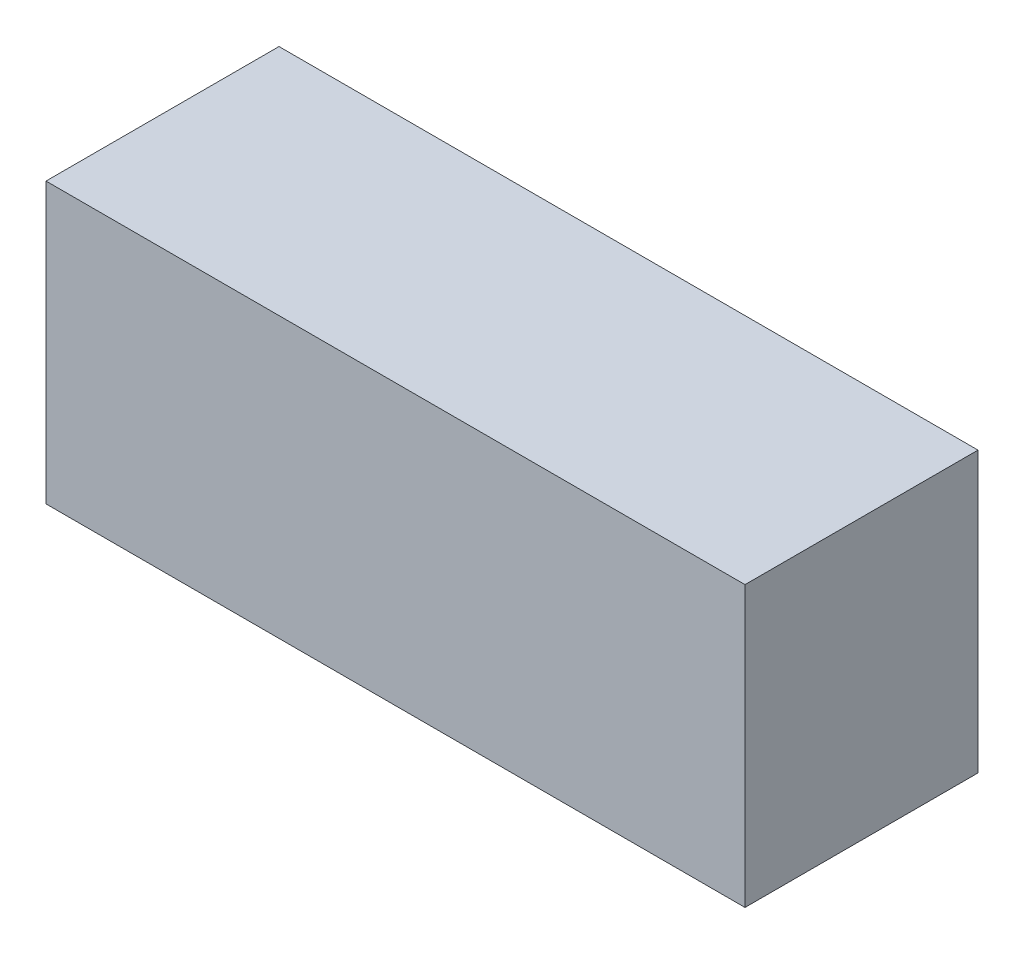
ISO-10303-21;
HEADER;
FILE_DESCRIPTION(('STEP AP214'),'2;1');
FILE_NAME('part.step','',(''),(''),'','','');
FILE_SCHEMA(('AUTOMOTIVE_DESIGN { 1 0 10303 214 1 1 1 1 }'));
ENDSEC;
DATA;
#1=APPLICATION_CONTEXT('core data for automotive mechanical design processes');
#2=APPLICATION_PROTOCOL_DEFINITION('international standard','automotive_design',2000,#1);
#3=PRODUCT_CONTEXT('',#1,'mechanical');
#4=PRODUCT('Part','Part','',(#3));
#5=PRODUCT_RELATED_PRODUCT_CATEGORY('part','',(#4));
#6=PRODUCT_DEFINITION_FORMATION('','',#4);
#7=PRODUCT_DEFINITION_CONTEXT('part definition',#1,'design');
#8=PRODUCT_DEFINITION('design','',#6,#7);
#9=PRODUCT_DEFINITION_SHAPE('','',#8);
#10=(LENGTH_UNIT() NAMED_UNIT(*) SI_UNIT(.MILLI.,.METRE.));
#11=(NAMED_UNIT(*) PLANE_ANGLE_UNIT() SI_UNIT($,.RADIAN.));
#12=(NAMED_UNIT(*) SI_UNIT($,.STERADIAN.) SOLID_ANGLE_UNIT());
#13=UNCERTAINTY_MEASURE_WITH_UNIT(LENGTH_MEASURE(1.E-05),#10,'distance_accuracy_value','');
#14=(GEOMETRIC_REPRESENTATION_CONTEXT(3) GLOBAL_UNCERTAINTY_ASSIGNED_CONTEXT((#13)) GLOBAL_UNIT_ASSIGNED_CONTEXT((#10,
#11,#12)) REPRESENTATION_CONTEXT('',''));
#15=CARTESIAN_POINT('',(0.,0.,0.));
#16=DIRECTION('',(0.,0.,1.));
#17=DIRECTION('',(1.,0.,0.));
#18=AXIS2_PLACEMENT_3D('',#15,#16,#17);
#19=CARTESIAN_POINT('',(0.,0.,10.));
#20=DIRECTION('',(1.,0.,0.));
#21=DIRECTION('',(0.,1.,0.));
#22=AXIS2_PLACEMENT_3D('',#19,#20,#21);
#23=PLANE('',#22);
#24=DIRECTION('',(0.,-1.,0.));
#25=VECTOR('',#24,1.);
#26=CARTESIAN_POINT('',(0.,0.,0.));
#27=LINE('',#26,#25);
#28=CARTESIAN_POINT('',(0.,0.,0.));
#29=VERTEX_POINT('',#28);
#30=CARTESIAN_POINT('',(0.,-12.,0.));
#31=VERTEX_POINT('',#30);
#32=EDGE_CURVE('E75',#29,#31,#27,.T.);
#33=ORIENTED_EDGE('',*,*,#32,.T.);
#34=DIRECTION('',(0.,0.,-1.));
#35=VECTOR('',#34,1.);
#36=CARTESIAN_POINT('',(0.,-12.,10.));
#37=LINE('',#36,#35);
#38=CARTESIAN_POINT('',(0.,-12.,10.));
#39=VERTEX_POINT('',#38);
#40=EDGE_CURVE('E11',#39,#31,#37,.T.);
#41=ORIENTED_EDGE('',*,*,#40,.F.);
#42=DIRECTION('',(0.,-1.,0.));
#43=VECTOR('',#42,1.);
#44=CARTESIAN_POINT('',(0.,0.,10.));
#45=LINE('',#44,#43);
#46=CARTESIAN_POINT('',(0.,0.,10.));
#47=VERTEX_POINT('',#46);
#48=EDGE_CURVE('E93',#47,#39,#45,.T.);
#49=ORIENTED_EDGE('',*,*,#48,.F.);
#50=DIRECTION('',(0.,0.,-1.));
#51=VECTOR('',#50,1.);
#52=CARTESIAN_POINT('',(0.,0.,10.));
#53=LINE('',#52,#51);
#54=EDGE_CURVE('E87',#47,#29,#53,.T.);
#55=ORIENTED_EDGE('',*,*,#54,.T.);
#56=EDGE_LOOP('',(#33,#41,#49,#55));
#57=FACE_BOUND('',#56,.T.);
#58=ADVANCED_FACE('F31',(#57),#23,.F.);
#59=CARTESIAN_POINT('',(0.,-12.,10.));
#60=DIRECTION('',(0.,1.,0.));
#61=DIRECTION('',(0.,0.,1.));
#62=AXIS2_PLACEMENT_3D('',#59,#60,#61);
#63=PLANE('',#62);
#64=DIRECTION('',(1.,0.,0.));
#65=VECTOR('',#64,1.);
#66=CARTESIAN_POINT('',(0.,-12.,0.));
#67=LINE('',#66,#65);
#68=CARTESIAN_POINT('',(30.,-12.,0.));
#69=VERTEX_POINT('',#68);
#70=EDGE_CURVE('E71',#31,#69,#67,.T.);
#71=ORIENTED_EDGE('',*,*,#70,.T.);
#72=DIRECTION('',(0.,0.,-1.));
#73=VECTOR('',#72,1.);
#74=CARTESIAN_POINT('',(30.,-12.,10.));
#75=LINE('',#74,#73);
#76=CARTESIAN_POINT('',(30.,-12.,10.));
#77=VERTEX_POINT('',#76);
#78=EDGE_CURVE('E38',#77,#69,#75,.T.);
#79=ORIENTED_EDGE('',*,*,#78,.F.);
#80=DIRECTION('',(1.,0.,0.));
#81=VECTOR('',#80,1.);
#82=CARTESIAN_POINT('',(0.,-12.,10.));
#83=LINE('',#82,#81);
#84=EDGE_CURVE('E83',#39,#77,#83,.T.);
#85=ORIENTED_EDGE('',*,*,#84,.F.);
#86=ORIENTED_EDGE('',*,*,#40,.T.);
#87=EDGE_LOOP('',(#71,#79,#85,#86));
#88=FACE_BOUND('',#87,.T.);
#89=ADVANCED_FACE('F82',(#88),#63,.F.);
#90=CARTESIAN_POINT('',(30.,0.,10.));
#91=DIRECTION('',(-1.,0.,0.));
#92=DIRECTION('',(0.,0.,1.));
#93=AXIS2_PLACEMENT_3D('',#90,#91,#92);
#94=PLANE('',#93);
#95=DIRECTION('',(0.,1.,0.));
#96=VECTOR('',#95,1.);
#97=CARTESIAN_POINT('',(30.,0.,0.));
#98=LINE('',#97,#96);
#99=CARTESIAN_POINT('',(30.,0.,0.));
#100=VERTEX_POINT('',#99);
#101=EDGE_CURVE('E76',#69,#100,#98,.T.);
#102=ORIENTED_EDGE('',*,*,#101,.T.);
#103=DIRECTION('',(0.,0.,-1.));
#104=VECTOR('',#103,1.);
#105=CARTESIAN_POINT('',(30.,0.,10.));
#106=LINE('',#105,#104);
#107=CARTESIAN_POINT('',(30.,0.,10.));
#108=VERTEX_POINT('',#107);
#109=EDGE_CURVE('E99',#108,#100,#106,.T.);
#110=ORIENTED_EDGE('',*,*,#109,.F.);
#111=DIRECTION('',(0.,1.,0.));
#112=VECTOR('',#111,1.);
#113=CARTESIAN_POINT('',(30.,0.,10.));
#114=LINE('',#113,#112);
#115=EDGE_CURVE('E50',#77,#108,#114,.T.);
#116=ORIENTED_EDGE('',*,*,#115,.F.);
#117=ORIENTED_EDGE('',*,*,#78,.T.);
#118=EDGE_LOOP('',(#102,#110,#116,#117));
#119=FACE_BOUND('',#118,.T.);
#120=ADVANCED_FACE('F102',(#119),#94,.F.);
#121=CARTESIAN_POINT('',(0.,0.,10.));
#122=DIRECTION('',(0.,-1.,0.));
#123=DIRECTION('',(0.,0.,-1.));
#124=AXIS2_PLACEMENT_3D('',#121,#122,#123);
#125=PLANE('',#124);
#126=DIRECTION('',(-1.,0.,0.));
#127=VECTOR('',#126,1.);
#128=CARTESIAN_POINT('',(0.,0.,0.));
#129=LINE('',#128,#127);
#130=EDGE_CURVE('E91',#100,#29,#129,.T.);
#131=ORIENTED_EDGE('',*,*,#130,.T.);
#132=ORIENTED_EDGE('',*,*,#54,.F.);
#133=DIRECTION('',(-1.,0.,0.));
#134=VECTOR('',#133,1.);
#135=CARTESIAN_POINT('',(0.,0.,10.));
#136=LINE('',#135,#134);
#137=EDGE_CURVE('E45',#108,#47,#136,.T.);
#138=ORIENTED_EDGE('',*,*,#137,.F.);
#139=ORIENTED_EDGE('',*,*,#109,.T.);
#140=EDGE_LOOP('',(#131,#132,#138,#139));
#141=FACE_BOUND('',#140,.T.);
#142=ADVANCED_FACE('F104',(#141),#125,.F.);
#143=CARTESIAN_POINT('',(0.,-12.,10.));
#144=DIRECTION('',(0.,0.,1.));
#145=DIRECTION('',(1.,0.,0.));
#146=AXIS2_PLACEMENT_3D('',#143,#144,#145);
#147=PLANE('',#146);
#148=ORIENTED_EDGE('',*,*,#48,.T.);
#149=ORIENTED_EDGE('',*,*,#84,.T.);
#150=ORIENTED_EDGE('',*,*,#115,.T.);
#151=ORIENTED_EDGE('',*,*,#137,.T.);
#152=EDGE_LOOP('',(#148,#149,#150,#151));
#153=FACE_BOUND('',#152,.T.);
#154=ADVANCED_FACE('F105',(#153),#147,.T.);
#155=CARTESIAN_POINT('',(0.,-12.,0.));
#156=DIRECTION('',(0.,0.,1.));
#157=DIRECTION('',(1.,0.,0.));
#158=AXIS2_PLACEMENT_3D('',#155,#156,#157);
#159=PLANE('',#158);
#160=ORIENTED_EDGE('',*,*,#32,.F.);
#161=ORIENTED_EDGE('',*,*,#130,.F.);
#162=ORIENTED_EDGE('',*,*,#101,.F.);
#163=ORIENTED_EDGE('',*,*,#70,.F.);
#164=EDGE_LOOP('',(#160,#161,#162,#163));
#165=FACE_BOUND('',#164,.T.);
#166=ADVANCED_FACE('F72',(#165),#159,.F.);
#167=CLOSED_SHELL('',(#58,#89,#120,#142,#154,#166));
#168=MANIFOLD_SOLID_BREP('B2',#167);
#169=ADVANCED_BREP_SHAPE_REPRESENTATION('',(#18,#168),#14);
#170=SHAPE_DEFINITION_REPRESENTATION(#9,#169);
ENDSEC;
END-ISO-10303-21;
